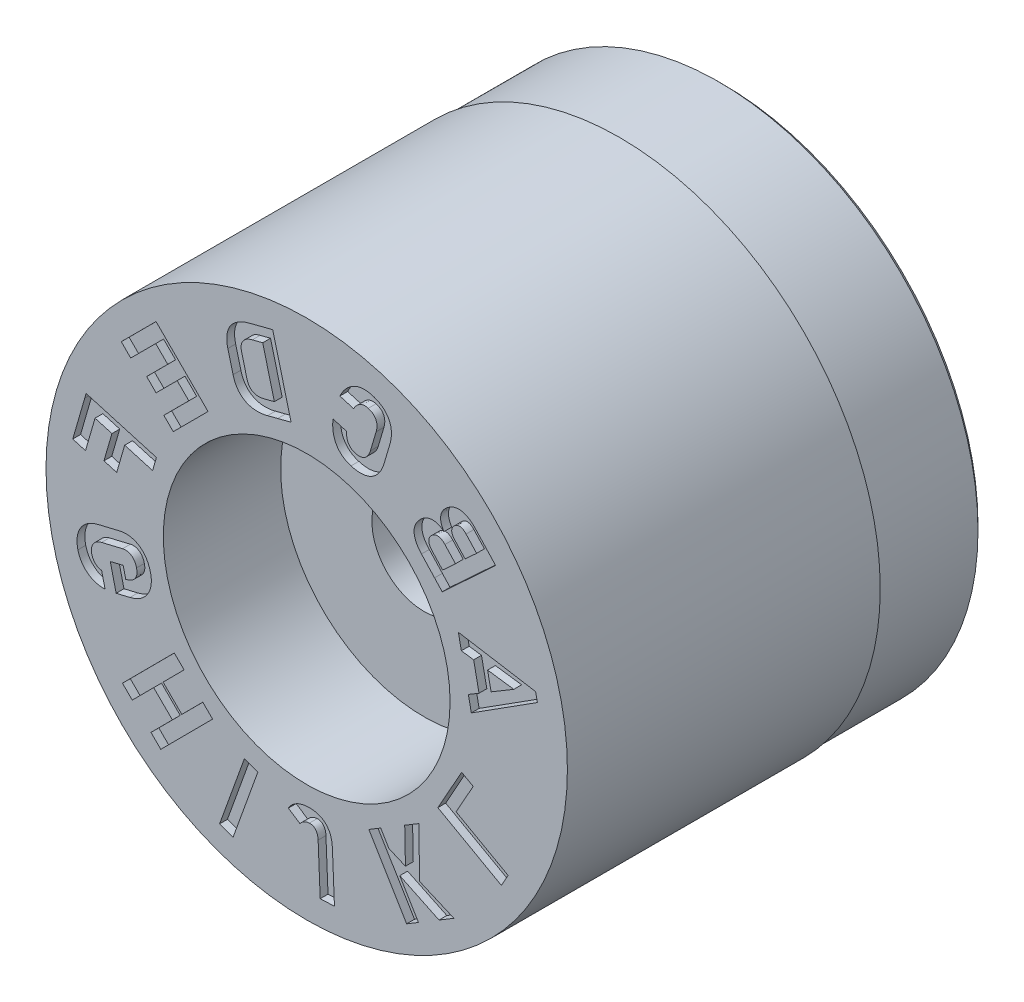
from build123d import *

# Parameters (mm, degrees)
SKETCH4_W          = 4
SKETCH4_H          = 1
CUT_EXTRUDE1_DEPTH = 0.3


with BuildPart() as part:
    # Sketch1 → Revolve1 (revolve)
    with BuildSketch(Plane(origin=(0, 0, 0), x_dir=(0, 0, -1), z_dir=(1, 0, 0)), mode=Mode.PRIVATE) as revolve1_sk:
        Polygon((0, 10), (0, 5.5), (4.5, 5.5), (4.5, 2), (16, 2), (16, 9.75), (15.75, 10), align=None)
    revolve(revolve1_sk.sketch.rotate(Axis((0, 0, 3.797909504), (0, 0, -1)), 90), axis=Axis((0, 0, 3.797909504), (0, 0, -1)))

    # Sketch4 → Cut-Revolve1 (revolve, cut)
    with BuildSketch(Plane(origin=(0, 0, 0), x_dir=(0, 0, -1), z_dir=(1, 0, 0)), mode=Mode.PRIVATE) as cut_revolve1_sk:
        with Locations((14, 10.435)):
            Rectangle(SKETCH4_W, SKETCH4_H)
    revolve(cut_revolve1_sk.sketch.rotate(Axis((0, 0, 0), (0, 0, -1)), 90), axis=Axis((0, 0, 0), (0, 0, -1)), mode=Mode.SUBTRACT)

    # Sketch6 → Cut-Extrude1 (cut)
    # profile 1 of 12: a face of its own
    with BuildSketch(Plane.XY):
        Polygon((6.404477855, 1.847011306), (6.609848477, 0.839738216), (6.200731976, 0.595250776), (6.314894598, 0.037769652), (8.848877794, 1.650142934), (8.781618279, 1.978831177), (5.818132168, 2.468982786), (5.93229479, 1.911501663), align=None)
        Polygon((7.072962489, 1.116494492), (6.938901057, 1.774020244), (7.943617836, 1.63679689), align=None, mode=Mode.SUBTRACT)
    # profile 2 of 12: a face of its own
    with BuildSketch(Plane.XY):
        with BuildLine():
            Line((4.38152409, 5.511607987), (4.37780413, 5.507888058))
            add(Edge.make_bspline(
                [(4.37780413, 5.507888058), (4.322593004, 5.457409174), (4.24977349, 5.374660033), (4.17849168, 5.250523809), (4.142597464, 5.156318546), (4.120741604, 5.060003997), (4.116040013, 4.961475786), (4.125586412, 4.861571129), (4.151076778, 4.760449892), (4.191843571, 4.659135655), (4.269232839, 4.520351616), (4.344695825, 4.423252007), (4.402394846, 4.361970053)],
                knots=[0, 0, 0, 0, 0.172445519, 0.251873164, 0.328716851, 0.403983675, 0.478532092, 0.555075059, 0.634512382, 0.718035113, 0.806069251, 1, 1, 1, 1], degree=3))
            Line((4.402394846, 4.361970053), (4.904738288, 3.819253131))
            Line((4.904738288, 3.819253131), (5.198153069, 3.502397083))
            Line((5.198153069, 3.502397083), (7.246974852, 5.399341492))
            Line((7.246974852, 5.399341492), (6.473404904, 6.234887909))
            add(Edge.make_bspline(
                [(6.473404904, 6.234887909), (6.416398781, 6.296534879), (6.32635052, 6.380174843), (6.193568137, 6.467168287), (6.09569988, 6.515008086), (5.997511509, 6.54845952), (5.899090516, 6.566082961), (5.800867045, 6.567973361), (5.70360964, 6.553739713), (5.607486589, 6.52538658), (5.479228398, 6.464373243), (5.392003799, 6.398255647), (5.33750943, 6.348022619)],
                knots=[0, 0, 0, 0, 0.19451309, 0.282787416, 0.366596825, 0.446050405, 0.522153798, 0.597136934, 0.672452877, 0.748829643, 0.828294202, 1, 1, 1, 1], degree=3))
            add(Edge.make_bspline(
                [(5.33750943, 6.348022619), (5.300256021, 6.312411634), (5.247978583, 6.256304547), (5.196857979, 6.170328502), (5.167367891, 6.105113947), (5.147924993, 6.037403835), (5.137310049, 5.968192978), (5.136086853, 5.897324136), (5.143653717, 5.82518917), (5.160978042, 5.752444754), (5.195392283, 5.652398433), (5.235317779, 5.581389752), (5.265251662, 5.5351932)],
                knots=[0, 0, 0, 0, 0.172669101, 0.253653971, 0.333238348, 0.41112289, 0.488218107, 0.566498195, 0.647255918, 0.729849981, 0.815785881, 1, 1, 1, 1], degree=3))
            add(Edge.make_bspline(
                [(5.265251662, 5.5351932), (5.220637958, 5.57335804), (5.148485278, 5.620882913), (5.045936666, 5.668088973), (4.969411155, 5.691586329), (4.892567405, 5.705294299), (4.816036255, 5.708046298), (4.739903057, 5.701674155), (4.664834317, 5.68325869), (4.590901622, 5.655789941), (4.492119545, 5.603634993), (4.424193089, 5.551306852), (4.38152409, 5.511607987)],
                knots=[0, 0, 0, 0, 0.179771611, 0.263567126, 0.345522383, 0.424654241, 0.502309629, 0.579813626, 0.658234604, 0.738636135, 0.82120181, 1, 1, 1, 1], degree=3))
        make_face()
        with BuildLine():
            add(Edge.make_bspline(
                [(5.67352623, 5.471164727), (5.640400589, 5.506892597), (5.597476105, 5.564144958), (5.567569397, 5.650178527), (5.559714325, 5.711658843), (5.566595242, 5.772453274), (5.59720197, 5.852682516), (5.638403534, 5.904880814), (5.671996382, 5.93484485)],
                knots=[0, 0, 0, 0, 0.278817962, 0.399136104, 0.515115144, 0.628924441, 0.74378033, 1, 1, 1, 1], degree=3))
            add(Edge.make_bspline(
                [(5.671996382, 5.93484485), (5.701647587, 5.96308261), (5.752879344, 5.99582003), (5.829626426, 6.015188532), (5.887297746, 6.013518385), (5.945632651, 5.999573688), (6.027217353, 5.961278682), (6.079071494, 5.912548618), (6.112875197, 5.878037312)],
                knots=[0, 0, 0, 0, 0.243701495, 0.354494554, 0.466945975, 0.58400697, 0.709939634, 1, 1, 1, 1], degree=3))
            Line((6.112875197, 5.878037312), (6.517684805, 5.44057252))
            Line((6.517684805, 5.44057252), (6.078289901, 5.033749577))
            Line((6.078289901, 5.033749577), (5.67352623, 5.471164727))
        make_face(mode=Mode.SUBTRACT)
        with BuildLine():
            Line((4.795005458, 5.173047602), (4.79929435, 5.176723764))
            add(Edge.make_bspline(
                [(4.79929435, 5.176723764), (4.823498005, 5.199018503), (4.862020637, 5.228544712), (4.918995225, 5.255287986), (4.96137553, 5.26831779), (5.004546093, 5.274233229), (5.047935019, 5.273206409), (5.091337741, 5.265162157), (5.13452787, 5.249990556), (5.177629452, 5.228779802), (5.236622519, 5.190999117), (5.275840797, 5.153399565), (5.301355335, 5.12665564)],
                knots=[0, 0, 0, 0, 0.172626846, 0.251574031, 0.328522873, 0.403934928, 0.478745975, 0.554865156, 0.634107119, 0.717711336, 0.805951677, 1, 1, 1, 1], degree=3))
            Line((5.301355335, 5.12665564), (5.706155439, 4.689201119))
            Line((5.706155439, 4.689201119), (5.213131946, 4.232725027))
            Line((5.213131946, 4.232725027), (4.808395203, 4.670111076))
            add(Edge.make_bspline(
                [(4.808395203, 4.670111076), (4.771903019, 4.709520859), (4.724423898, 4.772309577), (4.689364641, 4.866166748), (4.679557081, 4.933141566), (4.685797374, 4.998759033), (4.715438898, 5.085437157), (4.759700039, 5.141141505), (4.795005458, 5.173047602)],
                knots=[0, 0, 0, 0, 0.283314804, 0.406293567, 0.522920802, 0.635859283, 0.749287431, 1, 1, 1, 1], degree=3))
        make_face(mode=Mode.SUBTRACT)
    # profile 3 of 12: a face of its own
    with BuildSketch(Plane.XY):
        with BuildLine():
            Line((1.534596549, 6.998101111), (1.007972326, 7.153484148))
            add(Edge.make_bspline(
                [(1.007972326, 7.153484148), (0.996535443, 7.055932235), (0.991124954, 6.911630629), (1.010566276, 6.724926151), (1.039026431, 6.596927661), (1.079156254, 6.477678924), (1.131896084, 6.36788243), (1.19816483, 6.268445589), (1.275653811, 6.17864698), (1.365079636, 6.099545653), (1.502017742, 6.008941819), (1.617595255, 5.960564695), (1.698454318, 5.937178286)],
                knots=[0, 0, 0, 0, 0.19185114, 0.280863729, 0.365986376, 0.447454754, 0.526148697, 0.60318324, 0.680196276, 0.75722813, 0.835631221, 1, 1, 1, 1], degree=3))
            add(Edge.make_bspline(
                [(1.698454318, 5.937178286), (1.747878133, 5.922108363), (1.822165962, 5.904931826), (1.920795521, 5.888800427), (1.991782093, 5.881749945), (2.061237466, 5.87907971), (2.129031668, 5.881508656), (2.195223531, 5.887648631), (2.259518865, 5.898547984), (2.321805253, 5.91414384), (2.382272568, 5.933498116), (2.440239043, 5.957967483), (2.495486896, 5.987237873), (2.549377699, 6.019100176), (2.600577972, 6.056325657), (2.649036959, 6.098324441), (2.695799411, 6.143809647), (2.73942714, 6.19403229), (2.781030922, 6.247671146), (2.81967488, 6.305551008), (2.855478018, 6.367488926), (2.888627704, 6.433423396), (2.929187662, 6.528567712), (2.955647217, 6.602767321), (2.970564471, 6.654110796)],
                knots=[0, 0, 0, 0, 0.093296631, 0.137613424, 0.18049716, 0.222108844, 0.263102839, 0.302982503, 0.342144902, 0.380803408, 0.418912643, 0.456755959, 0.494311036, 0.531814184, 0.56978836, 0.608500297, 0.64760384, 0.687556, 0.728597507, 0.770187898, 0.81319677, 0.857791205, 0.903443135, 1, 1, 1, 1], degree=3))
            Line((2.970564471, 6.654110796), (3.189011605, 7.394056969))
            add(Edge.make_bspline(
                [(3.189011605, 7.394056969), (3.203489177, 7.445576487), (3.223414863, 7.522006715), (3.24019266, 7.624037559), (3.24819382, 7.697231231), (3.25116661, 7.768693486), (3.251087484, 7.838251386), (3.24556282, 7.905933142), (3.235519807, 7.971482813), (3.221585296, 8.035244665), (3.202937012, 8.096606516), (3.180311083, 8.15592353), (3.153243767, 8.212581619), (3.122159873, 8.266959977), (3.086402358, 8.318670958), (3.046437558, 8.367999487), (3.002803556, 8.415529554), (2.954864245, 8.459854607), (2.903053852, 8.501571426), (2.847219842, 8.540233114), (2.787526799, 8.576036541), (2.724055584, 8.608768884), (2.632674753, 8.649108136), (2.560654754, 8.674178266), (2.511006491, 8.688574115)],
                knots=[0, 0, 0, 0, 0.096695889, 0.142383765, 0.186623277, 0.229569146, 0.271486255, 0.312156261, 0.352061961, 0.391165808, 0.429912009, 0.467766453, 0.505704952, 0.543188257, 0.580759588, 0.619101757, 0.657756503, 0.697172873, 0.736887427, 0.777784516, 0.819711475, 0.86250185, 0.906661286, 1, 1, 1, 1], degree=3))
            add(Edge.make_bspline(
                [(2.511006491, 8.688574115), (2.430265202, 8.712287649), (2.306944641, 8.735153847), (2.142570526, 8.733345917), (2.024370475, 8.71561841), (1.910024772, 8.683333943), (1.800170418, 8.635533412), (1.695982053, 8.571857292), (1.596757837, 8.494222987), (1.504088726, 8.401738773), (1.386094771, 8.256364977), (1.314159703, 8.131303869), (1.270935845, 8.043330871)],
                knots=[0, 0, 0, 0, 0.164412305, 0.242917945, 0.320040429, 0.397162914, 0.474329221, 0.553242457, 0.635005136, 0.719817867, 0.808383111, 1, 1, 1, 1], degree=3))
            Line((1.270935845, 8.043330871), (1.797560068, 7.887947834))
            add(Edge.make_bspline(
                [(1.797560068, 7.887947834), (1.819207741, 7.927272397), (1.854810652, 7.98290904), (1.911492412, 8.047308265), (1.954958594, 8.08872837), (2.00078406, 8.123654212), (2.047871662, 8.153164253), (2.097673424, 8.174156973), (2.148374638, 8.190027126), (2.200635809, 8.198603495), (2.272402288, 8.201569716), (2.32608748, 8.190761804), (2.361046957, 8.180863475)],
                knots=[0, 0, 0, 0, 0.195070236, 0.285228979, 0.371952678, 0.455275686, 0.535053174, 0.612466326, 0.689229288, 0.765219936, 0.841733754, 1, 1, 1, 1], degree=3))
            add(Edge.make_bspline(
                [(2.361046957, 8.180863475), (2.405269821, 8.167558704), (2.468605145, 8.142725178), (2.541966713, 8.093830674), (2.5875591, 8.052056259), (2.625475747, 8.005110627), (2.655803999, 7.953079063), (2.677251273, 7.895809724), (2.691354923, 7.834008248), (2.697120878, 7.767918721), (2.692809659, 7.671674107), (2.676794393, 7.598820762), (2.66269698, 7.549919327)],
                knots=[0, 0, 0, 0, 0.174669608, 0.254393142, 0.331602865, 0.407223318, 0.481411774, 0.557967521, 0.637188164, 0.720073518, 0.807639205, 1, 1, 1, 1], degree=3))
            Line((2.66269698, 7.549919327), (2.444249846, 6.809973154))
            add(Edge.make_bspline(
                [(2.444249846, 6.809973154), (2.429299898, 6.761259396), (2.403357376, 6.691315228), (2.353908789, 6.608704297), (2.313577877, 6.556496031), (2.268946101, 6.51180613), (2.219079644, 6.477016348), (2.166390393, 6.448672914), (2.108866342, 6.430421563), (2.047988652, 6.420834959), (1.959844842, 6.419123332), (1.893124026, 6.432705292), (1.84872345, 6.445368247)],
                knots=[0, 0, 0, 0, 0.193100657, 0.280209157, 0.363265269, 0.442165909, 0.518056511, 0.59248688, 0.667664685, 0.745105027, 0.824928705, 1, 1, 1, 1], degree=3))
            add(Edge.make_bspline(
                [(1.84872345, 6.445368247), (1.813486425, 6.456655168), (1.76194486, 6.476914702), (1.701969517, 6.517752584), (1.662303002, 6.552881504), (1.627483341, 6.593307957), (1.597587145, 6.638297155), (1.573254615, 6.688170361), (1.553724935, 6.742215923), (1.540077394, 6.800877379), (1.529205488, 6.886554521), (1.530533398, 6.953043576), (1.534596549, 6.998101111)],
                knots=[0, 0, 0, 0, 0.160269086, 0.23668427, 0.312318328, 0.388485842, 0.466474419, 0.544946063, 0.627589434, 0.714157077, 0.804508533, 1, 1, 1, 1], degree=3))
        make_face()
    # profile 4 of 12: a face of its own
    with BuildSketch(Plane.XY):
        with BuildLine():
            Line((-1.49850105, 6.005661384), (-1.112724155, 6.105355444))
            Line((-1.112724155, 6.105355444), (-1.112685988, 6.105207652))
            Line((-1.112685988, 6.105207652), (-0.599799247, 6.23795644))
            Line((-0.599799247, 6.23795644), (-1.302913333, 8.96061737))
            Line((-1.302913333, 8.96061737), (-2.20338909, 8.72799204))
            add(Edge.make_bspline(
                [(-2.20338909, 8.72799204), (-2.258246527, 8.714039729), (-2.338112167, 8.689960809), (-2.439983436, 8.650351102), (-2.511178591, 8.618976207), (-2.578352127, 8.58450428), (-2.641303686, 8.546805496), (-2.700686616, 8.50718106), (-2.75541499, 8.464124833), (-2.806416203, 8.419354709), (-2.852391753, 8.371250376), (-2.894780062, 8.321578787), (-2.931590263, 8.268581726), (-2.96470348, 8.214094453), (-2.992885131, 8.15686171), (-3.016640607, 8.097435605), (-3.03598534, 8.035639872), (-3.05110564, 7.971887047), (-3.060735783, 7.90614679), (-3.067034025, 7.83863409), (-3.067161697, 7.769191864), (-3.063828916, 7.698042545), (-3.05269526, 7.599091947), (-3.036378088, 7.524952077), (-3.024027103, 7.475039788)],
                knots=[0, 0, 0, 0, 0.099691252, 0.146684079, 0.192416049, 0.236651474, 0.279547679, 0.321579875, 0.362276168, 0.40209594, 0.440981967, 0.479364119, 0.516966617, 0.554483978, 0.591557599, 0.62917203, 0.667080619, 0.705497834, 0.744424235, 0.784000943, 0.824800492, 0.86659578, 0.909393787, 1, 1, 1, 1], degree=3))
            Line((-3.024027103, 7.475039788), (-2.825211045, 6.703908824))
            add(Edge.make_bspline(
                [(-2.825211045, 6.703908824), (-2.812347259, 6.656553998), (-2.791298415, 6.586845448), (-2.754490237, 6.498649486), (-2.724840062, 6.436253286), (-2.69162602, 6.377495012), (-2.655122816, 6.32206478), (-2.615163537, 6.270390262), (-2.572674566, 6.221455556), (-2.5268345, 6.176378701), (-2.477987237, 6.13536191), (-2.426040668, 6.098552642), (-2.371082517, 6.065597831), (-2.313338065, 6.036235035), (-2.252229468, 6.011784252), (-2.188370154, 5.99100048), (-2.121627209, 5.973726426), (-2.052072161, 5.961603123), (-1.980021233, 5.953355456), (-1.905631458, 5.950834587), (-1.828685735, 5.951790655), (-1.749527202, 5.958028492), (-1.638550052, 5.973647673), (-1.554656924, 5.990455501), (-1.49850105, 6.005661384)],
                knots=[0, 0, 0, 0, 0.086582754, 0.128100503, 0.168414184, 0.208325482, 0.247011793, 0.285335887, 0.323422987, 0.36120022, 0.398570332, 0.435771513, 0.473335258, 0.511474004, 0.549867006, 0.589259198, 0.629828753, 0.671312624, 0.713652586, 0.757595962, 0.802457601, 0.849282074, 0.89748781, 1, 1, 1, 1], degree=3))
        make_face()
        with BuildLine():
            Line((-1.688216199, 8.33382695), (-1.240352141, 6.599567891))
            Line((-1.240352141, 6.599567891), (-1.63925886, 6.496500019))
            add(Edge.make_bspline(
                [(-1.63925886, 6.496500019), (-1.679135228, 6.485719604), (-1.738398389, 6.47466863), (-1.816344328, 6.468434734), (-1.870658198, 6.468045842), (-1.922449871, 6.473572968), (-1.97197746, 6.48260668), (-2.018472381, 6.497578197), (-2.062692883, 6.516120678), (-2.10309917, 6.540404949), (-2.141165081, 6.567666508), (-2.17465311, 6.600694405), (-2.20562074, 6.636980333), (-2.23207294, 6.67821469), (-2.263279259, 6.740135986), (-2.281393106, 6.790238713), (-2.289892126, 6.825599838)],
                knots=[0, 0, 0, 0, 0.149537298, 0.217661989, 0.283028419, 0.345893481, 0.406043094, 0.464997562, 0.522452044, 0.579275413, 0.635371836, 0.691586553, 0.749135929, 0.807832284, 0.868484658, 1, 1, 1, 1], degree=3))
            Line((-2.289892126, 6.825599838), (-2.496649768, 7.627556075))
            add(Edge.make_bspline(
                [(-2.496649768, 7.627556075), (-2.505722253, 7.662609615), (-2.51579455, 7.715124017), (-2.517744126, 7.784604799), (-2.513913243, 7.833474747), (-2.505138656, 7.880358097), (-2.491491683, 7.925319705), (-2.472506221, 7.968312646), (-2.447477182, 8.008507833), (-2.418739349, 8.046926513), (-2.3846638, 8.082044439), (-2.346329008, 8.114244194), (-2.303605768, 8.143958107), (-2.255817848, 8.170027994), (-2.184474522, 8.202310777), (-2.127063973, 8.220979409), (-2.087136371, 8.230755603)],
                knots=[0, 0, 0, 0, 0.131188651, 0.192463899, 0.251082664, 0.308289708, 0.364767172, 0.420806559, 0.477847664, 0.535795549, 0.59415501, 0.654506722, 0.716775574, 0.782177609, 0.851241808, 1, 1, 1, 1], degree=3))
            Line((-2.087136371, 8.230755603), (-1.688216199, 8.33382695))
        make_face(mode=Mode.SUBTRACT)
    # profile 5 of 12: a face of its own
    with BuildSketch(Plane.XY):
        Polygon((-7.112818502, 5.656449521), (-6.750042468, 5.294546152), (-5.791214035, 6.255056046), (-5.330591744, 5.795278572), (-6.138625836, 4.985830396), (-5.77699261, 4.624494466), (-4.968775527, 5.434125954), (-4.521288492, 4.987459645), (-5.480323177, 4.026743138), (-5.11811934, 3.665408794), (-3.784309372, 5.00150293), (-5.779008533, 6.992543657), align=None)
    # profile 6 of 12: a face of its own
    with BuildSketch(Plane.XY):
        Polygon((6.386567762, -2.366571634), (5.943776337, -2.118917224), (5.030383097, -3.750892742), (7.467118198, -5.114151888), (7.724093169, -4.654919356), (5.730188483, -3.539406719), align=None)
    # profile 7 of 12: a face of its own
    with BuildSketch(Plane.XY):
        Polygon((4.298696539, -4.646190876), (3.759502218, -4.9703581), (3.78772824, -6.31853237), (3.153188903, -6.045693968), (2.83941856, -5.523807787), (2.384959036, -5.796713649), (3.834640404, -8.207931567), (4.289099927, -7.935025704), (3.57041047, -6.739647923), (5.075223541, -7.462255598), (5.647581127, -7.118229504), (4.332685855, -6.552852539), align=None)
    # profile 8 of 12: a face of its own
    with BuildSketch(Plane.XY):
        with BuildLine():
            Line((1.064460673, -9.009024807), (0.985081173, -7.098566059))
            add(Edge.make_bspline(
                [(0.985081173, -7.098566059), (0.982426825, -7.051877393), (0.977719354, -6.982949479), (0.962296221, -6.893738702), (0.947748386, -6.83078403), (0.93089211, -6.770365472), (0.910678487, -6.712650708), (0.886466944, -6.658221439), (0.851317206, -6.589712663), (0.799623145, -6.510750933), (0.724487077, -6.428404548), (0.638600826, -6.357932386), (0.557630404, -6.311654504), (0.48814231, -6.281179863), (0.433315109, -6.260828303), (0.375640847, -6.245469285), (0.315746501, -6.232533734), (0.25343657, -6.222743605), (0.165434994, -6.215898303), (0.098305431, -6.214677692), (0.052847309, -6.216996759)],
                knots=[0, 0, 0, 0, 0.096260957, 0.141810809, 0.186072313, 0.229115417, 0.270772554, 0.31172379, 0.351538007, 0.429095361, 0.504996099, 0.579976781, 0.656704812, 0.695920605, 0.73600492, 0.7768495, 0.818556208, 0.862015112, 0.906457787, 1, 1, 1, 1], degree=3))
            add(Edge.make_bspline(
                [(0.052847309, -6.216996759), (-0.028822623, -6.220817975), (-0.149163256, -6.23636485), (-0.299738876, -6.285938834), (-0.402367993, -6.333875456), (-0.495555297, -6.392844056), (-0.603948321, -6.486102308), (-0.669564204, -6.57043819), (-0.703107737, -6.632511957)],
                knots=[0, 0, 0, 0, 0.272275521, 0.400402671, 0.525908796, 0.648158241, 0.765974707, 1, 1, 1, 1], degree=3))
            Line((-0.703107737, -6.632511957), (-0.258573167, -6.928516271))
            add(Edge.make_bspline(
                [(-0.258573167, -6.928516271), (-0.237371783, -6.89879442), (-0.201190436, -6.857698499), (-0.144441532, -6.812651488), (-0.098804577, -6.784191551), (-0.050462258, -6.761498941), (0.015922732, -6.737824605), (0.068276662, -6.730142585), (0.103130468, -6.728135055)],
                knots=[0, 0, 0, 0, 0.256042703, 0.381066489, 0.506919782, 0.632263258, 0.754859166, 1, 1, 1, 1], degree=3))
            add(Edge.make_bspline(
                [(0.103130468, -6.728135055), (0.148938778, -6.725987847), (0.218089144, -6.734679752), (0.296905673, -6.778944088), (0.34537727, -6.825264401), (0.384046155, -6.884016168), (0.425569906, -6.982226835), (0.435243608, -7.066069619), (0.438059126, -7.123798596)],
                knots=[0, 0, 0, 0, 0.235778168, 0.345103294, 0.457449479, 0.575518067, 0.702626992, 1, 1, 1, 1], degree=3))
            Line((0.438059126, -7.123798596), (0.517816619, -9.031935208))
            Line((0.517816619, -9.031935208), (1.064460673, -9.009024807))
        make_face()
    # profile 9 of 12: a face of its own
    with BuildSketch(Plane.XY):
        Polygon((-3.341284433, -8.477180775), (-2.824719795, -8.6632051), (-1.873677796, -6.019988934), (-2.390242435, -5.833964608), align=None)
    # profile 10 of 12: a face of its own
    with BuildSketch(Plane.XY):
        Polygon((-3.985679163, -4.754338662), (-4.790803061, -5.563777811), (-5.508363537, -4.850243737), (-4.703329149, -4.040894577), (-5.079352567, -3.666561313), (-7.066889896, -5.664751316), (-6.690866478, -6.03908458), (-5.869449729, -5.213265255), (-5.151889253, -5.926799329), (-5.973216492, -6.752528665), (-5.596619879, -7.12742995), (-3.60908255, -5.129239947), align=None)
    # profile 11 of 12: a face of its own
    with BuildSketch(Plane.XY):
        with BuildLine():
            add(Edge.make_bspline(
                [(-7.065641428, -1.197408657), (-7.025331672, -1.187004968), (-6.964047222, -1.180931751), (-6.883437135, -1.18688704), (-6.826484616, -1.200687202), (-6.772675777, -1.222252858), (-6.722480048, -1.250976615), (-6.677077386, -1.287707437), (-6.635839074, -1.331122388), (-6.599921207, -1.381362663), (-6.557562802, -1.457956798), (-6.537226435, -1.522087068), (-6.526470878, -1.56627561)],
                knots=[0, 0, 0, 0, 0.169158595, 0.249202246, 0.328415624, 0.406962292, 0.484801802, 0.563206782, 0.644146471, 0.728139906, 0.814249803, 1, 1, 1, 1], degree=3))
            add(Edge.make_bspline(
                [(-6.526470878, -1.56627561), (-6.516022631, -1.609894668), (-6.506752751, -1.675702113), (-6.512133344, -1.762129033), (-6.524719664, -1.822359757), (-6.545050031, -1.879151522), (-6.572871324, -1.931939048), (-6.609202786, -1.98012382), (-6.653201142, -2.023176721), (-6.704492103, -2.061270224), (-6.784067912, -2.105469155), (-6.850529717, -2.128217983), (-6.896989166, -2.138882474)],
                knots=[0, 0, 0, 0, 0.174616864, 0.256198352, 0.335686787, 0.413135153, 0.490105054, 0.566861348, 0.64687476, 0.728727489, 0.814622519, 1, 1, 1, 1], degree=3))
            Line((-6.896989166, -2.138882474), (-6.941347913, -2.149779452))
            Line((-6.941347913, -2.149779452), (-7.039472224, -1.737791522))
            Line((-7.039472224, -1.737791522), (-7.53431769, -1.855389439))
            Line((-7.53431769, -1.855389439), (-7.309514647, -2.799188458))
            Line((-7.309514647, -2.799188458), (-6.777703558, -2.672509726))
            add(Edge.make_bspline(
                [(-6.777703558, -2.672509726), (-6.728498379, -2.661068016), (-6.656752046, -2.639658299), (-6.564537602, -2.604682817), (-6.499632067, -2.5750792), (-6.43790276, -2.542107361), (-6.379626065, -2.505394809), (-6.32398906, -2.466125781), (-6.272139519, -2.423067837), (-6.223547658, -2.377556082), (-6.178756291, -2.329473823), (-6.138251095, -2.278715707), (-6.101542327, -2.225841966), (-6.069560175, -2.170234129), (-6.040417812, -2.112942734), (-6.016685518, -2.052529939), (-5.996538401, -1.990067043), (-5.980351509, -1.925677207), (-5.969015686, -1.859759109), (-5.961854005, -1.792730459), (-5.959082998, -1.72452912), (-5.96072371, -1.655021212), (-5.970738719, -1.559426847), (-5.982921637, -1.487470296), (-5.994659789, -1.439596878)],
                knots=[0, 0, 0, 0, 0.092042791, 0.136304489, 0.179677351, 0.221988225, 0.263767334, 0.305151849, 0.346029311, 0.386510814, 0.426440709, 0.465693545, 0.504791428, 0.543642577, 0.582543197, 0.621845, 0.661806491, 0.702119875, 0.742754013, 0.783625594, 0.824911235, 0.867095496, 0.910233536, 1, 1, 1, 1], degree=3))
            add(Edge.make_bspline(
                [(-5.994659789, -1.439596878), (-6.006257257, -1.391445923), (-6.02695412, -1.320898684), (-6.061210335, -1.230264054), (-6.090243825, -1.166342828), (-6.122877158, -1.105754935), (-6.158386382, -1.048130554), (-6.19668374, -0.993286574), (-6.238687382, -0.942167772), (-6.28308394, -0.894585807), (-6.329634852, -0.850503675), (-6.378678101, -0.810542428), (-6.430241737, -0.774399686), (-6.48415345, -0.742294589), (-6.540270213, -0.713997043), (-6.598548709, -0.689627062), (-6.659198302, -0.669878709), (-6.721393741, -0.653970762), (-6.78501302, -0.642716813), (-6.849672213, -0.634580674), (-6.91589606, -0.632553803), (-6.98333147, -0.633720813), (-7.076051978, -0.643033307), (-7.145713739, -0.654718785), (-7.192062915, -0.666106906)],
                knots=[0, 0, 0, 0, 0.092528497, 0.13719136, 0.180939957, 0.223599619, 0.265685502, 0.307350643, 0.348480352, 0.389193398, 0.428877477, 0.468172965, 0.507286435, 0.546427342, 0.585307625, 0.624625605, 0.664330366, 0.704381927, 0.744469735, 0.784980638, 0.826022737, 0.868147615, 0.91091225, 1, 1, 1, 1], degree=3))
            Line((-7.192062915, -0.666106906), (-7.994878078, -0.857421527))
            add(Edge.make_bspline(
                [(-7.994878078, -0.857421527), (-8.044079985, -0.868868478), (-8.115835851, -0.890262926), (-8.208035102, -0.925262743), (-8.272982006, -0.954800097), (-8.334547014, -0.988003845), (-8.393196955, -1.023731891), (-8.44843534, -1.063234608), (-8.500082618, -1.105934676), (-8.548307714, -1.151338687), (-8.592538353, -1.199407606), (-8.633350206, -1.249655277), (-8.668506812, -1.303519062), (-8.702313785, -1.358000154), (-8.729721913, -1.416357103), (-8.754558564, -1.476390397), (-8.774410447, -1.539127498), (-8.790857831, -1.603336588), (-8.801371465, -1.66928583), (-8.808736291, -1.736163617), (-8.81144862, -1.804375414), (-8.809824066, -1.873880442), (-8.799803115, -1.969475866), (-8.787623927, -2.041431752), (-8.775884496, -2.089305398)],
                knots=[0, 0, 0, 0, 0.092141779, 0.136451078, 0.179870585, 0.222226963, 0.26402075, 0.305106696, 0.34602812, 0.386220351, 0.425867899, 0.46516295, 0.504167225, 0.543165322, 0.582039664, 0.621644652, 0.661649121, 0.70200586, 0.742477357, 0.783392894, 0.824722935, 0.866952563, 0.910136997, 1, 1, 1, 1], degree=3))
            add(Edge.make_bspline(
                [(-8.775884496, -2.089305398), (-8.75750263, -2.16811704), (-8.717068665, -2.281940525), (-8.640201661, -2.421766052), (-8.570920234, -2.516545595), (-8.491950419, -2.602199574), (-8.404096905, -2.677176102), (-8.307842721, -2.740985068), (-8.203869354, -2.79330504), (-8.093381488, -2.833974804), (-7.937122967, -2.871171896), (-7.81565457, -2.879637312), (-7.734092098, -2.876182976)],
                knots=[0, 0, 0, 0, 0.170781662, 0.253604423, 0.336230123, 0.418123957, 0.499153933, 0.579581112, 0.661460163, 0.744460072, 0.827691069, 1, 1, 1, 1], degree=3))
            Line((-7.734092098, -2.876182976), (-7.866219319, -2.322192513))
            add(Edge.make_bspline(
                [(-7.866219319, -2.322192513), (-7.89626943, -2.319344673), (-7.94142666, -2.311361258), (-7.9974486, -2.287922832), (-8.037466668, -2.266014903), (-8.074569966, -2.239018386), (-8.109213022, -2.208647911), (-8.140799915, -2.174238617), (-8.196745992, -2.097872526), (-8.229734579, -2.024455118), (-8.244073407, -1.962626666)],
                knots=[0, 0, 0, 0, 0.162957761, 0.244283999, 0.326105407, 0.408112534, 0.490852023, 0.573863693, 0.659070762, 1, 1, 1, 1], degree=3))
            add(Edge.make_bspline(
                [(-8.244073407, -1.962626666), (-8.254627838, -1.919633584), (-8.262494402, -1.854346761), (-8.255994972, -1.768623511), (-8.243052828, -1.708140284), (-8.221820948, -1.650970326), (-8.192130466, -1.598014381), (-8.155329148, -1.54897986), (-8.11016758, -1.50543597), (-8.058859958, -1.466381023), (-7.979382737, -1.422785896), (-7.914302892, -1.398952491), (-7.86845659, -1.388723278)],
                knots=[0, 0, 0, 0, 0.171944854, 0.253181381, 0.333045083, 0.411487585, 0.489167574, 0.568154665, 0.648783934, 0.732130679, 0.817931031, 1, 1, 1, 1], degree=3))
            Line((-7.86845659, -1.388723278), (-7.065641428, -1.197408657))
        make_face()
    # profile 12 of 12: a face of its own
    with BuildSketch(Plane.XY):
        Polygon((-8.974152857, 1.491275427), (-8.484467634, 1.349533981), (-8.119018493, 2.612875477), (-7.471099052, 2.425533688), (-7.777412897, 1.366680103), (-7.287727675, 1.224938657), (-6.981373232, 2.283932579), (-5.91122295, 1.974505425), (-5.764233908, 2.483153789), (-8.46194583, 3.26318005), (-8.515307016, 3.077485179), align=None)
    extrude(amount=-CUT_EXTRUDE1_DEPTH, mode=Mode.SUBTRACT)


solid = part.part
